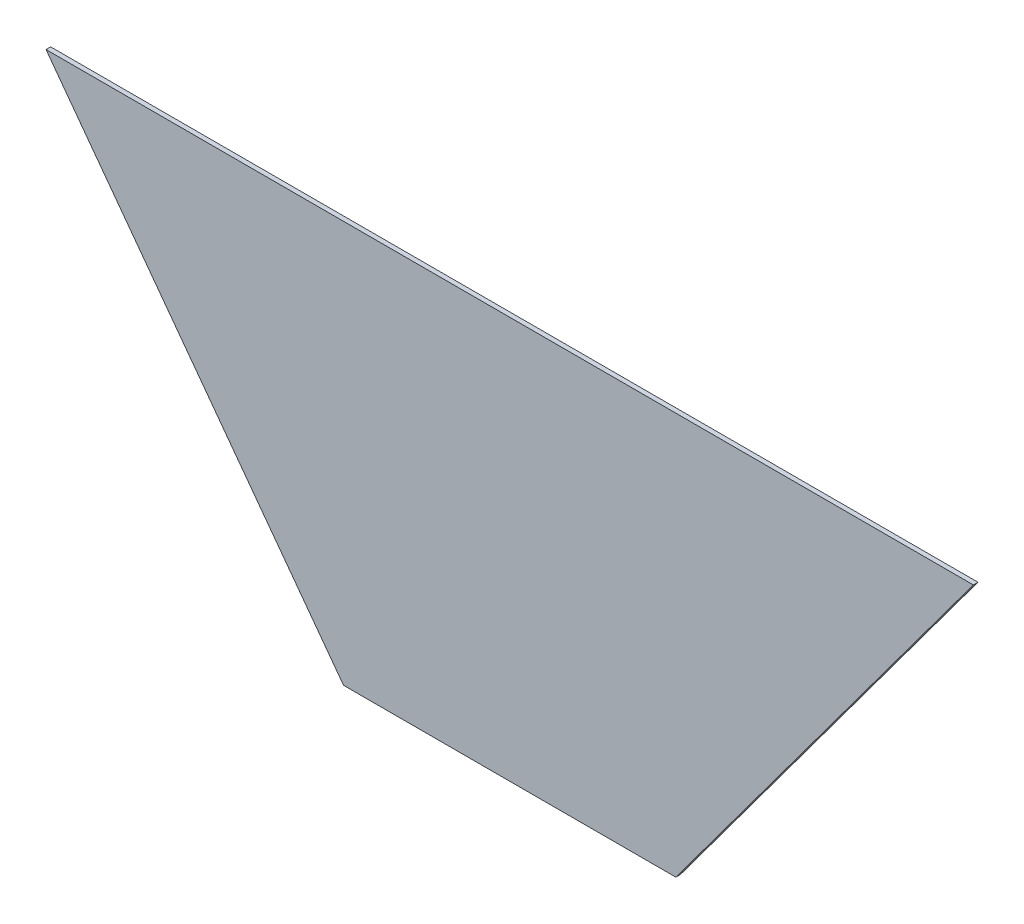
from build123d import *

# Parameters (mm, degrees)
EXTRUDE_1_DEPTH = 3


with BuildPart() as part:
    # Sketch 1 → Extrude 1 (new body)
    with BuildSketch(Plane.XY):
        Polygon((-107.5, 0), (107.5, 0), (300, 260), (-300, 260), align=None)
    extrude(amount=EXTRUDE_1_DEPTH)


solid = part.part
